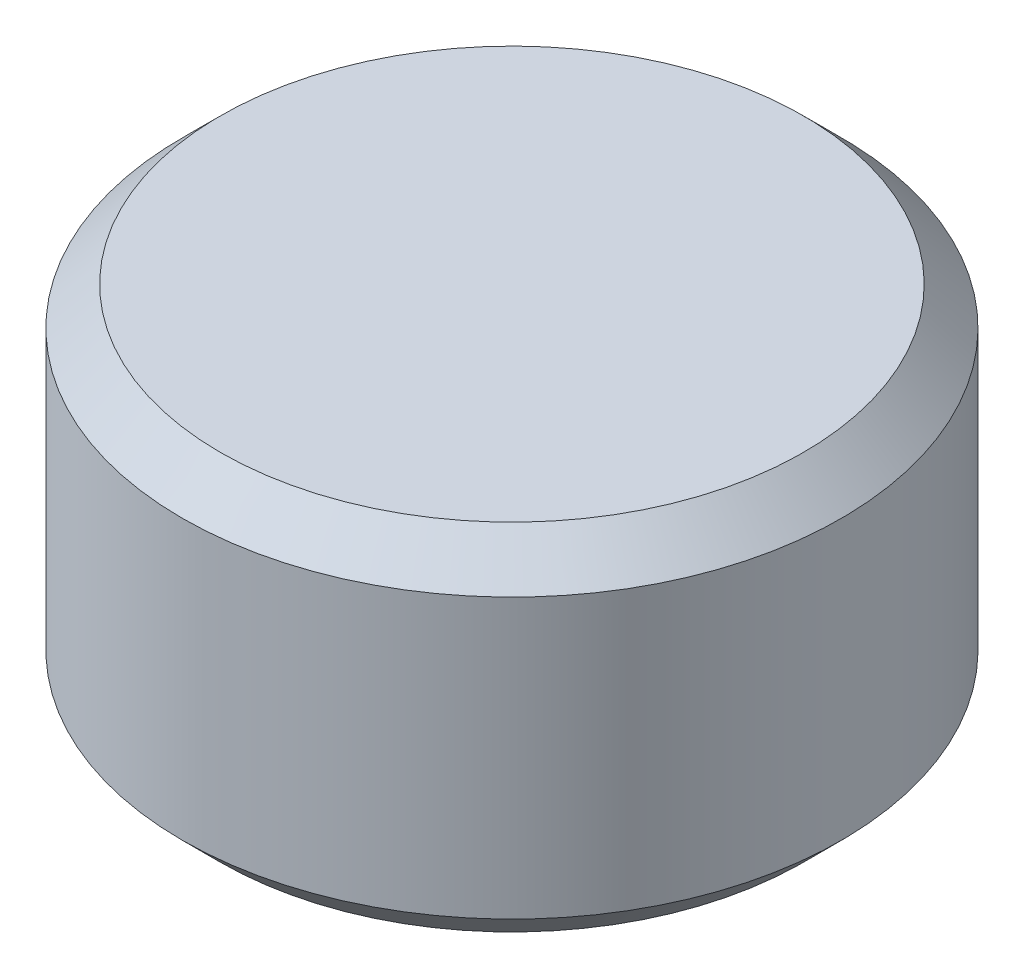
from build123d import *

# Parameters (mm, degrees)
SKETCH_1_R      = 13
EXTRUDE_1_DEPTH = 14
CHAMFER_1_SIZE  = 1.5


with BuildPart() as part:
    # Sketch 1 → Extrude 1 (new body)
    with BuildSketch(Plane(origin=(0, 0, 0), x_dir=(1, 0, 0), z_dir=(0, 1, 0))):
        with Locations(Location((0, 0, 0), (0, 0, 270))):
            Circle(SKETCH_1_R)
    extrude(amount=EXTRUDE_1_DEPTH)

    # Chamfer 1
    chamfer_1_edges = [part.edges().sort_by_distance(p)[0] for p in [
        (0, 0, -13),
        (0, 14, -13),
    ]]
    chamfer(chamfer_1_edges, length=CHAMFER_1_SIZE)


solid = part.part
